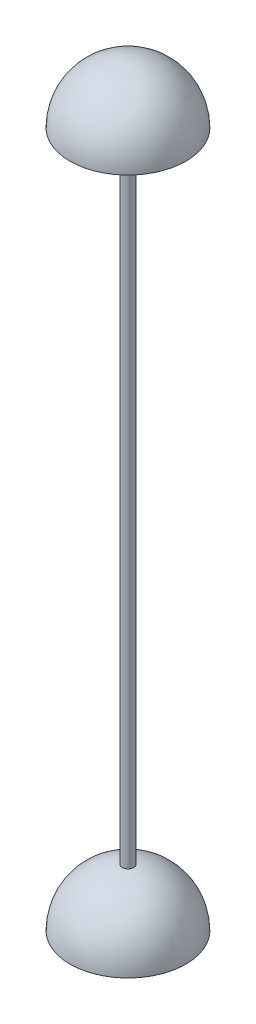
ISO-10303-21;
HEADER;
FILE_DESCRIPTION(('STEP AP214'),'2;1');
FILE_NAME('part.step','',(''),(''),'','','');
FILE_SCHEMA(('AUTOMOTIVE_DESIGN { 1 0 10303 214 1 1 1 1 }'));
ENDSEC;
DATA;
#1=APPLICATION_CONTEXT('core data for automotive mechanical design processes');
#2=APPLICATION_PROTOCOL_DEFINITION('international standard','automotive_design',2000,#1);
#3=PRODUCT_CONTEXT('',#1,'mechanical');
#4=PRODUCT('Part','Part','',(#3));
#5=PRODUCT_RELATED_PRODUCT_CATEGORY('part','',(#4));
#6=PRODUCT_DEFINITION_FORMATION('','',#4);
#7=PRODUCT_DEFINITION_CONTEXT('part definition',#1,'design');
#8=PRODUCT_DEFINITION('design','',#6,#7);
#9=PRODUCT_DEFINITION_SHAPE('','',#8);
#10=(LENGTH_UNIT() NAMED_UNIT(*) SI_UNIT(.MILLI.,.METRE.));
#11=(NAMED_UNIT(*) PLANE_ANGLE_UNIT() SI_UNIT($,.RADIAN.));
#12=(NAMED_UNIT(*) SI_UNIT($,.STERADIAN.) SOLID_ANGLE_UNIT());
#13=UNCERTAINTY_MEASURE_WITH_UNIT(LENGTH_MEASURE(1.E-05),#10,'distance_accuracy_value','');
#14=(GEOMETRIC_REPRESENTATION_CONTEXT(3) GLOBAL_UNCERTAINTY_ASSIGNED_CONTEXT((#13)) GLOBAL_UNIT_ASSIGNED_CONTEXT((#10,
#11,#12)) REPRESENTATION_CONTEXT('',''));
#15=CARTESIAN_POINT('',(0.,0.,0.));
#16=DIRECTION('',(0.,0.,1.));
#17=DIRECTION('',(1.,0.,0.));
#18=AXIS2_PLACEMENT_3D('',#15,#16,#17);
#19=CARTESIAN_POINT('',(0.,0.,0.));
#20=DIRECTION('',(0.,0.,-1.));
#21=DIRECTION('',(-1.,0.,0.));
#22=AXIS2_PLACEMENT_3D('',#19,#20,#21);
#23=SPHERICAL_SURFACE('',#22,100.);
#24=CARTESIAN_POINT('',(0.,0.,0.));
#25=DIRECTION('',(0.,-1.,0.));
#26=DIRECTION('',(1.,0.,0.));
#27=AXIS2_PLACEMENT_3D('',#24,#25,#26);
#28=SPHERICAL_SURFACE('',#27,100.);
#29=CARTESIAN_POINT('',(-6.94796013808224E-13,99.498743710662,0.));
#30=DIRECTION('',(0.,-1.,0.));
#31=DIRECTION('',(1.,0.,0.));
#32=AXIS2_PLACEMENT_3D('',#29,#30,#31);
#33=CIRCLE('',#32,10.);
#34=CARTESIAN_POINT('',(9.99999999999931,99.4987437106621,0.));
#35=VERTEX_POINT('',#34);
#36=EDGE_CURVE('E11',#35,#35,#33,.T.);
#37=ORIENTED_EDGE('',*,*,#36,.T.);
#38=EDGE_LOOP('',(#37));
#39=FACE_BOUND('',#38,.T.);
#40=ADVANCED_FACE('F39',(#39),#28,.F.);
#41=CARTESIAN_POINT('',(-8.37955521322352E-12,1200.,0.));
#42=DIRECTION('',(0.,-1.,0.));
#43=DIRECTION('',(1.,0.,0.));
#44=AXIS2_PLACEMENT_3D('',#41,#42,#43);
#45=PLANE('',#44);
#46=CARTESIAN_POINT('',(-8.37955521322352E-12,1200.,0.));
#47=DIRECTION('',(0.,-1.,0.));
#48=DIRECTION('',(1.,0.,0.));
#49=AXIS2_PLACEMENT_3D('',#46,#47,#48);
#50=CIRCLE('',#49,10.);
#51=CARTESIAN_POINT('',(9.99999999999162,1200.,0.));
#52=VERTEX_POINT('',#51);
#53=EDGE_CURVE('E45',#52,#52,#50,.T.);
#54=ORIENTED_EDGE('',*,*,#53,.F.);
#55=EDGE_LOOP('',(#54));
#56=FACE_BOUND('',#55,.T.);
#57=ADVANCED_FACE('F54',(#56),#45,.F.);
#58=CARTESIAN_POINT('',(0.,-0.00200000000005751,0.));
#59=DIRECTION('',(0.,1.,0.));
#60=DIRECTION('',(-1.,0.,0.));
#61=AXIS2_PLACEMENT_3D('',#58,#59,#60);
#62=CYLINDRICAL_SURFACE('',#61,10.);
#63=ORIENTED_EDGE('',*,*,#53,.T.);
#64=EDGE_LOOP('',(#63));
#65=FACE_BOUND('',#64,.T.);
#66=ORIENTED_EDGE('',*,*,#36,.F.);
#67=EDGE_LOOP('',(#66));
#68=FACE_BOUND('',#67,.T.);
#69=ADVANCED_FACE('F51',(#65,#68),#62,.T.);
#70=CLOSED_SHELL('',(#40,#57,#69));
#71=MANIFOLD_SOLID_BREP('B2',#70);
#72=CARTESIAN_POINT('',(0.,1200.,0.));
#73=DIRECTION('',(0.,0.,-1.));
#74=DIRECTION('',(-1.,0.,0.));
#75=AXIS2_PLACEMENT_3D('',#72,#73,#74);
#76=SPHERICAL_SURFACE('',#75,80.);
#77=CARTESIAN_POINT('',(0.,1200.,0.));
#78=DIRECTION('',(0.,-1.,0.));
#79=DIRECTION('',(1.,0.,0.));
#80=AXIS2_PLACEMENT_3D('',#77,#78,#79);
#81=SPHERICAL_SURFACE('',#80,80.);
#82=CARTESIAN_POINT('',(0.,1200.,0.));
#83=DIRECTION('',(0.,-1.,0.));
#84=DIRECTION('',(1.,0.,0.));
#85=AXIS2_PLACEMENT_3D('',#82,#83,#84);
#86=CIRCLE('',#85,80.);
#87=CARTESIAN_POINT('',(80.,1200.,0.));
#88=VERTEX_POINT('',#87);
#89=EDGE_CURVE('E93',#88,#88,#86,.T.);
#90=ORIENTED_EDGE('',*,*,#89,.F.);
#91=EDGE_LOOP('',(#90));
#92=FACE_BOUND('',#91,.T.);
#93=CARTESIAN_POINT('',(0.,1205.,0.));
#94=DIRECTION('',(0.,-1.,0.));
#95=DIRECTION('',(1.,0.,0.));
#96=AXIS2_PLACEMENT_3D('',#93,#94,#95);
#97=CIRCLE('',#96,79.8435971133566);
#98=CARTESIAN_POINT('',(79.8435971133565,1205.,0.));
#99=VERTEX_POINT('',#98);
#100=EDGE_CURVE('E38',#99,#99,#97,.T.);
#101=ORIENTED_EDGE('',*,*,#100,.T.);
#102=EDGE_LOOP('',(#101));
#103=FACE_BOUND('',#102,.T.);
#104=ADVANCED_FACE('F87',(#92,#103),#81,.T.);
#105=CARTESIAN_POINT('',(0.,1200.,0.));
#106=DIRECTION('',(0.,-1.,0.));
#107=DIRECTION('',(1.,0.,0.));
#108=AXIS2_PLACEMENT_3D('',#105,#106,#107);
#109=PLANE('',#108);
#110=ORIENTED_EDGE('',*,*,#89,.T.);
#111=EDGE_LOOP('',(#110));
#112=FACE_BOUND('',#111,.T.);
#113=ADVANCED_FACE('F99',(#112),#109,.T.);
#114=CARTESIAN_POINT('',(0.,1205.,0.));
#115=DIRECTION('',(0.,-1.,0.));
#116=DIRECTION('',(1.,0.,0.));
#117=AXIS2_PLACEMENT_3D('',#114,#115,#116);
#118=PLANE('',#117);
#119=ORIENTED_EDGE('',*,*,#100,.F.);
#120=EDGE_LOOP('',(#119));
#121=FACE_BOUND('',#120,.T.);
#122=ADVANCED_FACE('F102',(#121),#118,.F.);
#123=CLOSED_SHELL('',(#104,#113,#122));
#124=MANIFOLD_SOLID_BREP('B6',#123);
#125=CARTESIAN_POINT('',(0.,1200.,0.));
#126=DIRECTION('',(0.,0.,-1.));
#127=DIRECTION('',(-1.,0.,0.));
#128=AXIS2_PLACEMENT_3D('',#125,#126,#127);
#129=SPHERICAL_SURFACE('',#128,80.);
#130=CARTESIAN_POINT('',(0.,1200.,0.));
#131=DIRECTION('',(0.,1.,0.));
#132=DIRECTION('',(0.,0.,1.));
#133=AXIS2_PLACEMENT_3D('',#130,#131,#132);
#134=SPHERICAL_SURFACE('',#133,80.);
#135=CARTESIAN_POINT('',(0.,1200.,0.));
#136=DIRECTION('',(0.,1.,0.));
#137=DIRECTION('',(0.,0.,1.));
#138=AXIS2_PLACEMENT_3D('',#135,#136,#137);
#139=CIRCLE('',#138,80.);
#140=CARTESIAN_POINT('',(0.,1200.,80.));
#141=VERTEX_POINT('',#140);
#142=EDGE_CURVE('E141',#141,#141,#139,.T.);
#143=ORIENTED_EDGE('',*,*,#142,.F.);
#144=EDGE_LOOP('',(#143));
#145=FACE_BOUND('',#144,.T.);
#146=ADVANCED_FACE('F134',(#145),#134,.F.);
#147=CARTESIAN_POINT('',(0.,1200.,0.));
#148=DIRECTION('',(0.,0.,-1.));
#149=DIRECTION('',(-1.,0.,0.));
#150=AXIS2_PLACEMENT_3D('',#147,#148,#149);
#151=SPHERICAL_SURFACE('',#150,100.);
#152=CARTESIAN_POINT('',(0.,1200.,0.));
#153=DIRECTION('',(0.,-1.,0.));
#154=DIRECTION('',(0.,0.,1.));
#155=AXIS2_PLACEMENT_3D('',#152,#153,#154);
#156=SPHERICAL_SURFACE('',#155,100.);
#157=CARTESIAN_POINT('',(0.,1200.,0.));
#158=DIRECTION('',(0.,-1.,0.));
#159=DIRECTION('',(0.,0.,1.));
#160=AXIS2_PLACEMENT_3D('',#157,#158,#159);
#161=CIRCLE('',#160,100.);
#162=CARTESIAN_POINT('',(0.,1200.,100.));
#163=VERTEX_POINT('',#162);
#164=EDGE_CURVE('E86',#163,#163,#161,.T.);
#165=ORIENTED_EDGE('',*,*,#164,.F.);
#166=EDGE_LOOP('',(#165));
#167=FACE_BOUND('',#166,.T.);
#168=ADVANCED_FACE('F136',(#167),#156,.T.);
#169=CARTESIAN_POINT('',(0.,1200.,0.));
#170=DIRECTION('',(0.,-1.,0.));
#171=DIRECTION('',(0.,0.,1.));
#172=AXIS2_PLACEMENT_3D('',#169,#170,#171);
#173=PLANE('',#172);
#174=ORIENTED_EDGE('',*,*,#164,.T.);
#175=EDGE_LOOP('',(#174));
#176=FACE_BOUND('',#175,.T.);
#177=ORIENTED_EDGE('',*,*,#142,.T.);
#178=EDGE_LOOP('',(#177));
#179=FACE_BOUND('',#178,.T.);
#180=ADVANCED_FACE('F147',(#176,#179),#173,.T.);
#181=CLOSED_SHELL('',(#146,#168,#180));
#182=MANIFOLD_SOLID_BREP('B33',#181);
#183=CARTESIAN_POINT('',(0.,0.,0.));
#184=DIRECTION('',(0.,0.,-1.));
#185=DIRECTION('',(-1.,0.,0.));
#186=AXIS2_PLACEMENT_3D('',#183,#184,#185);
#187=SPHERICAL_SURFACE('',#186,80.);
#188=CARTESIAN_POINT('',(0.,0.,0.));
#189=DIRECTION('',(0.,1.,0.));
#190=DIRECTION('',(0.,0.,1.));
#191=AXIS2_PLACEMENT_3D('',#188,#189,#190);
#192=SPHERICAL_SURFACE('',#191,80.);
#193=CARTESIAN_POINT('',(0.,0.,0.));
#194=DIRECTION('',(0.,1.,0.));
#195=DIRECTION('',(0.,0.,1.));
#196=AXIS2_PLACEMENT_3D('',#193,#194,#195);
#197=CIRCLE('',#196,80.);
#198=CARTESIAN_POINT('',(0.,0.,80.));
#199=VERTEX_POINT('',#198);
#200=EDGE_CURVE('E184',#199,#199,#197,.T.);
#201=ORIENTED_EDGE('',*,*,#200,.F.);
#202=EDGE_LOOP('',(#201));
#203=FACE_BOUND('',#202,.T.);
#204=ADVANCED_FACE('F177',(#203),#192,.F.);
#205=CARTESIAN_POINT('',(0.,0.,0.));
#206=DIRECTION('',(0.,0.,-1.));
#207=DIRECTION('',(-1.,0.,0.));
#208=AXIS2_PLACEMENT_3D('',#205,#206,#207);
#209=SPHERICAL_SURFACE('',#208,100.);
#210=CARTESIAN_POINT('',(0.,0.,0.));
#211=DIRECTION('',(0.,-1.,0.));
#212=DIRECTION('',(0.,0.,1.));
#213=AXIS2_PLACEMENT_3D('',#210,#211,#212);
#214=SPHERICAL_SURFACE('',#213,100.);
#215=CARTESIAN_POINT('',(0.,0.,0.));
#216=DIRECTION('',(0.,-1.,0.));
#217=DIRECTION('',(0.,0.,1.));
#218=AXIS2_PLACEMENT_3D('',#215,#216,#217);
#219=CIRCLE('',#218,100.);
#220=CARTESIAN_POINT('',(0.,0.,100.));
#221=VERTEX_POINT('',#220);
#222=EDGE_CURVE('E133',#221,#221,#219,.T.);
#223=ORIENTED_EDGE('',*,*,#222,.F.);
#224=EDGE_LOOP('',(#223));
#225=FACE_BOUND('',#224,.T.);
#226=ADVANCED_FACE('F179',(#225),#214,.T.);
#227=CARTESIAN_POINT('',(0.,0.,0.));
#228=DIRECTION('',(0.,-1.,0.));
#229=DIRECTION('',(0.,0.,1.));
#230=AXIS2_PLACEMENT_3D('',#227,#228,#229);
#231=PLANE('',#230);
#232=ORIENTED_EDGE('',*,*,#222,.T.);
#233=EDGE_LOOP('',(#232));
#234=FACE_BOUND('',#233,.T.);
#235=ORIENTED_EDGE('',*,*,#200,.T.);
#236=EDGE_LOOP('',(#235));
#237=FACE_BOUND('',#236,.T.);
#238=ADVANCED_FACE('F190',(#234,#237),#231,.T.);
#239=CLOSED_SHELL('',(#204,#226,#238));
#240=MANIFOLD_SOLID_BREP('B81',#239);
#241=ADVANCED_BREP_SHAPE_REPRESENTATION('',(#18,#71,#124,#182,#240),#14);
#242=SHAPE_DEFINITION_REPRESENTATION(#9,#241);
ENDSEC;
END-ISO-10303-21;
